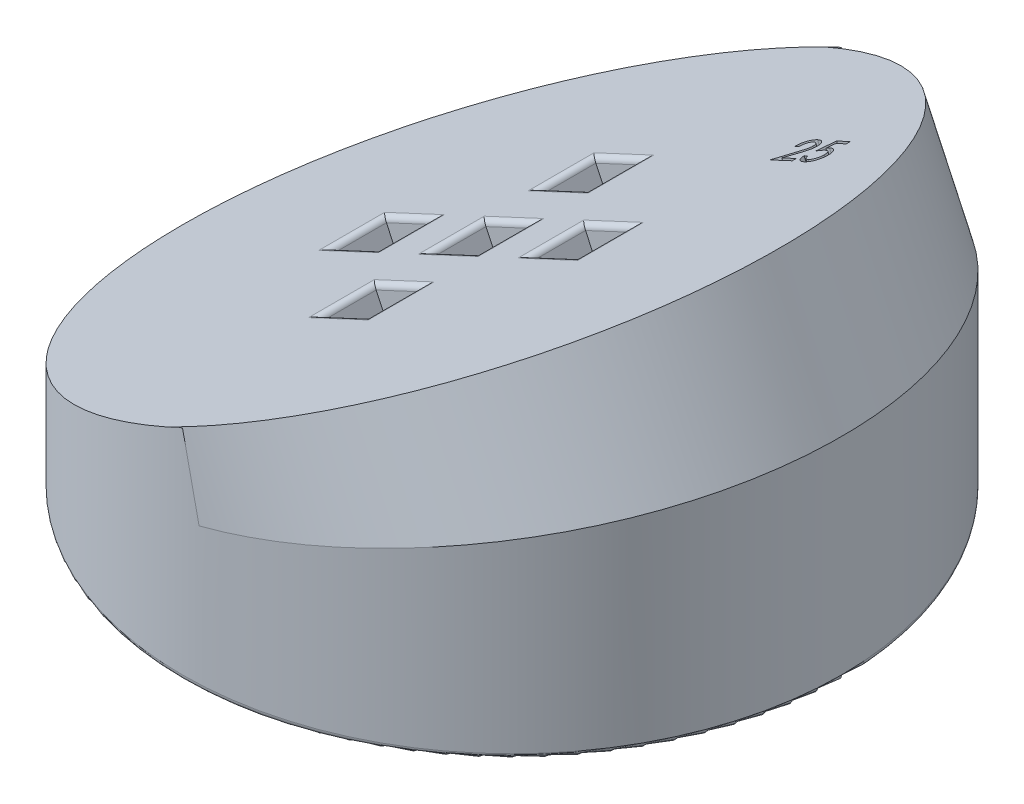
from build123d import *

# Parameters (mm, degrees)
SKETCH1_R           = 30
BOSS_EXTRUDE1_DEPTH = 50
SKETCH4_W           = 5
SKETCH4_H           = 5
CUT_EXTRUDE2_DEPTH  = 3
FILLET2_R           = 0.5
CUT_EXTRUDE10_DEPTH = 45
SKETCH15_W          = 5
SKETCH15_H          = 5
CUT_EXTRUDE11_DEPTH = 3
CUT_EXTRUDE13_DEPTH = 100
FILLET8_R           = 0.5
FILLET9_R           = 0.5
FILLET10_R          = 0.5
FILLET11_R          = 0.5
FILLET12_R          = 0.5
CUT_EXTRUDE14_DEPTH = 4


with BuildPart() as part:
    # Sketch1 → Boss-Extrude1 (new body)
    with BuildSketch(Plane(origin=(0, 0, 0), x_dir=(1, 0, 0), z_dir=(0, 1, 0))):
        with Locations(Location((0, 0, 0), (0, 0, 270))):
            Circle(SKETCH1_R)
    extrude(amount=BOSS_EXTRUDE1_DEPTH)

    # Sketch4 → Cut-Extrude2 (cut)
    with BuildSketch(Plane(origin=(0, 0, 0), x_dir=(-1, 0, 0), z_dir=(0, -1, 0))):
        Rectangle(SKETCH4_W, SKETCH4_H)
        with Locations((0, -10)):
            Rectangle(SKETCH4_W, SKETCH4_H)
        with Locations((10, 0)):
            Rectangle(SKETCH4_W, SKETCH4_H)
        with Locations((-10, 0)):
            Rectangle(SKETCH4_W, SKETCH4_H)
        with Locations((0, 10)):
            Rectangle(SKETCH4_W, SKETCH4_H)
    extrude(amount=-CUT_EXTRUDE2_DEPTH, mode=Mode.SUBTRACT)

    # Fillet2
    fillet2_edges = [part.edges().sort_by_distance(p)[0] for p in [
        (0, 0, -30),
        (-2.5, 0, 10),
        (0, 0, 7.5),
        (2.5, 0, 10),
        (0, 0, 12.5),
        (-12.5, 0, 0),
        (-10, 0, -2.5),
        (-7.5, 0, 0),
        (-10, 0, 2.5),
        (7.5, 0, 0),
        (10, 0, -2.5),
        (12.5, 0, 0),
        (10, 0, 2.5),
        (2.5, 0, -10),
        (0, 0, -7.5),
        (-2.5, 0, -10),
        (0, 0, -12.5),
        (-2.5, 0, 0),
        (0, 0, -2.5),
        (2.5, 0, 0),
        (0, 0, 2.5),
    ]]
    fillet(fillet2_edges, radius=FILLET2_R)

    # Sketch13 → Cut-Extrude10 (cut, symmetric)
    with BuildSketch(Plane.XY.offset(3.5)):
        Polygon((-30, 6), (30, 33.978459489), (30, 50), (-30, 50), align=None)
    extrude(amount=CUT_EXTRUDE10_DEPTH, both=True, mode=Mode.SUBTRACT)

    # Sketch15 → Cut-Extrude11 (cut)
    with BuildSketch(Plane(origin=(-7.656319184, 16.419029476, 0), x_dir=(0.9063077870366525, 0.4226182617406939, 0), z_dir=(-0.4226182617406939, 0.9063077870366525, 0))):
        with Locations((-4.653524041, 0)):
            Rectangle(SKETCH15_W, SKETCH15_H)
        with Locations((5.346475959, 0)):
            Rectangle(SKETCH15_W, SKETCH15_H)
        with Locations((15.346475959, 0)):
            Rectangle(SKETCH15_W, SKETCH15_H)
        with Locations((5.346475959, -10)):
            Rectangle(SKETCH15_W, SKETCH15_H)
        with Locations((5.346475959, 10)):
            Rectangle(SKETCH15_W, SKETCH15_H)
    extrude(amount=-CUT_EXTRUDE11_DEPTH, mode=Mode.SUBTRACT)

    # Sketch24 → Cut-Extrude13 (cut)
    with BuildSketch(Plane(origin=(-7.656319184, 16.419029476, 0), x_dir=(0.9063077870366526, 0.42261826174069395, 0), z_dir=(-0.42261826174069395, 0.9063077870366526, 0))):
        with BuildLine():
            ThreePointArc((6.820931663, 29.963744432), (35.346475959, 0), (6.820931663, -29.963744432))
            add(Edge.make_bspline(
                [(8.447813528, -30), (7.633880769, -30), (6.820931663, -29.963744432)],
                knots=[4.71238898, 4.71238898, 4.71238898, 4.766461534, 4.766461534, 4.766461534], degree=2, weights=[1, 0.989917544, 0.980529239]))
            add(Edge.make_bspline(
                [(41.549151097, 0), (41.549151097, -30), (8.447813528, -30)],
                knots=[3.141592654, 3.141592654, 3.141592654, 4.71238898, 4.71238898, 4.71238898], degree=2, weights=[1, 0.707106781, 1]))
            add(Edge.make_bspline(
                [(6.820931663, 29.963744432), (7.633880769, 30), (8.447813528, 30), (41.549151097, 30), (41.549151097, 0)],
                knots=[1.516723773, 1.516723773, 1.516723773, 1.570796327, 1.570796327, 3.141592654, 3.141592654, 3.141592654], degree=2, weights=[0.980529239, 0.989917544, 1, 0.707106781, 1]))
        make_face()
    extrude(amount=-CUT_EXTRUDE13_DEPTH, mode=Mode.SUBTRACT)

    # Fillet8
    fillet8_edges = [part.edges().sort_by_distance(p)[0] for p in [
        (-5.076535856, 17.622002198, -10),
        (-2.810766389, 18.678547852, -7.5),
        (-0.544996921, 19.735093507, -10),
        (-2.810766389, 18.678547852, -12.5),
    ]]
    fillet(fillet8_edges, radius=FILLET8_R)

    # Fillet9
    fillet9_edges = [part.edges().sort_by_distance(p)[0] for p in [
        (3.986542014, 21.848184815, 0),
        (6.252311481, 22.90473047, 2.5),
        (8.518080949, 23.961276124, 0),
        (6.252311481, 22.90473047, -2.5),
    ]]
    fillet(fillet9_edges, radius=FILLET9_R)

    # Fillet10
    fillet10_edges = [part.edges().sort_by_distance(p)[0] for p in [
        (-14.139613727, 13.39581958, 0),
        (-11.873844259, 14.452365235, 2.5),
        (-9.608074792, 15.508910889, 0),
        (-11.873844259, 14.452365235, -2.5),
    ]]
    fillet(fillet10_edges, radius=FILLET10_R)

    # Fillet11
    fillet11_edges = [part.edges().sort_by_distance(p)[0] for p in [
        (-5.076535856, 17.622002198, 10),
        (-2.810766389, 18.678547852, 12.5),
        (-0.544996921, 19.735093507, 10),
        (-2.810766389, 18.678547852, 7.5),
    ]]
    fillet(fillet11_edges, radius=FILLET11_R)

    # Fillet12
    fillet12_edges = [part.edges().sort_by_distance(p)[0] for p in [
        (-5.076535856, 17.622002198, 0),
        (-2.810766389, 18.678547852, 2.5),
        (-0.544996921, 19.735093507, 0),
        (-2.810766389, 18.678547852, -2.5),
    ]]
    fillet(fillet12_edges, radius=FILLET12_R)

    # Sketch25 → Cut-Extrude14 (cut)
    with BuildSketch(Plane(origin=(-7.656319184, 16.419029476, 0), x_dir=(0.9063077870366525, 0.4226182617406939, 0), z_dir=(-0.4226182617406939, 0.9063077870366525, 0))):
        with BuildLine():
            Line((20.596750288, 15.111406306), (20.19415113, 15.111406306))
            add(Edge.make_bspline(
                [(20.19415113, 15.111406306), (20.196042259, 15.152372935), (20.199741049, 15.232498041), (20.216165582, 15.349249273), (20.242772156, 15.459258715), (20.276355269, 15.563458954), (20.321154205, 15.660547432), (20.372843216, 15.75221665), (20.435243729, 15.8365454), (20.505759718, 15.913667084), (20.582307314, 15.983735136), (20.664596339, 16.044153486), (20.751235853, 16.095638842), (20.842242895, 16.137651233), (20.937795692, 16.170180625), (21.037621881, 16.193851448), (21.142039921, 16.208088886), (21.213219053, 16.209652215), (21.249304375, 16.210444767)],
                knots=[0, 0, 0, 0, 1.154964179, 2.258951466, 3.315045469, 4.34063582, 5.337653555, 6.322213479, 7.300594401, 8.285733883, 9.262436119, 10.219305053, 11.156568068, 12.097250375, 13.037875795, 13.995471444, 14.983774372, 16, 16, 16, 16], degree=3))
            add(Edge.make_bspline(
                [(21.249304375, 16.210444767), (21.287085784, 16.209671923), (21.361223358, 16.208155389), (21.46918552, 16.193884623), (21.571361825, 16.170873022), (21.667782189, 16.139447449), (21.758270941, 16.097486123), (21.843006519, 16.046885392), (21.921174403, 15.986065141), (21.993341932, 15.918011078), (22.057084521, 15.843151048), (22.11465717, 15.766186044), (22.162246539, 15.685555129), (22.202114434, 15.602730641), (22.232793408, 15.517032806), (22.254458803, 15.428810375), (22.267445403, 15.338003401), (22.269217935, 15.276600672), (22.270112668, 15.245606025)],
                knots=[0, 0, 0, 0, 1.156722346, 2.269809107, 3.328396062, 4.361258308, 5.3694338, 6.377253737, 7.377324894, 8.397019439, 9.4098266, 10.385180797, 11.337325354, 12.27255833, 13.196816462, 14.119704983, 15.050871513, 16, 16, 16, 16], degree=3))
            add(Edge.make_bspline(
                [(22.270112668, 15.245606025), (22.268484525, 15.202249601), (22.265250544, 15.1161307), (22.240347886, 14.98872273), (22.198483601, 14.865418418), (22.150126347, 14.765016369), (22.101218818, 14.683859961), (22.056336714, 14.616872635), (22.003611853, 14.544439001), (21.941913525, 14.467043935), (21.873695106, 14.382916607), (21.796246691, 14.294227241), (21.711965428, 14.19918026), (21.651857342, 14.135180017), (21.62073867, 14.10204633)],
                knots=[0, 0, 0, 0, 1.155755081, 2.295677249, 3.447123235, 4.6205014, 5.259503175, 5.973005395, 6.77029923, 7.648035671, 8.612336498, 9.658570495, 10.787814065, 12, 12, 12, 12], degree=3))
            Line((21.62073867, 14.10204633), (20.839709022, 13.320380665))
            Line((20.839709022, 13.320380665), (22.310817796, 13.320380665))
            Line((22.310817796, 13.320380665), (22.310817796, 12.954034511))
            Line((22.310817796, 12.954034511), (20.072035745, 12.954034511))
            Line((20.072035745, 12.954034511), (21.286829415, 14.295395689))
            add(Edge.make_bspline(
                [(21.286829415, 14.295395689), (21.31576419, 14.326254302), (21.371290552, 14.385472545), (21.449547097, 14.472158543), (21.520152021, 14.552298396), (21.583481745, 14.625834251), (21.637877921, 14.693754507), (21.684803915, 14.755059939), (21.723728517, 14.810040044), (21.764151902, 14.874756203), (21.804207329, 14.95233328), (21.838281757, 15.046966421), (21.858728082, 15.143607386), (21.861616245, 15.208622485), (21.863061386, 15.241153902)],
                knots=[0, 0, 0, 0, 1.341560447, 2.574479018, 3.703506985, 4.728875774, 5.651874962, 6.462761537, 7.177175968, 7.787249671, 8.88179658, 9.938774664, 10.968630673, 12, 12, 12, 12], degree=3))
            add(Edge.make_bspline(
                [(21.863061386, 15.241153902), (21.862705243, 15.261335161), (21.86200054, 15.301267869), (21.852393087, 15.359744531), (21.838859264, 15.41646364), (21.817927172, 15.470513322), (21.792707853, 15.522956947), (21.761162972, 15.573116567), (21.723283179, 15.620526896), (21.681145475, 15.666254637), (21.634540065, 15.707541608), (21.585313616, 15.744569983), (21.532860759, 15.774641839), (21.478615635, 15.800940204), (21.420892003, 15.819584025), (21.361108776, 15.833465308), (21.298796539, 15.843081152), (21.256337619, 15.843754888), (21.234675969, 15.844098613)],
                knots=[0, 0, 0, 0, 0.999432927, 1.977580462, 2.931018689, 3.885672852, 4.844657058, 5.812871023, 6.815890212, 7.849665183, 8.891901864, 9.898878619, 10.897592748, 11.885014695, 12.882178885, 13.896915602, 14.927050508, 16, 16, 16, 16], degree=3))
            add(Edge.make_bspline(
                [(21.234675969, 15.844098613), (21.214082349, 15.843676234), (21.17356929, 15.842845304), (21.113903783, 15.834272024), (21.056632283, 15.820313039), (21.001561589, 15.800950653), (20.948292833, 15.777063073), (20.898128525, 15.74611676), (20.850248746, 15.710116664), (20.804020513, 15.669711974), (20.761947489, 15.622309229), (20.724316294, 15.568470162), (20.691086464, 15.508136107), (20.662683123, 15.441412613), (20.639143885, 15.36812463), (20.620260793, 15.288361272), (20.605662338, 15.202087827), (20.599775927, 15.142192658), (20.596750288, 15.111406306)],
                knots=[0, 0, 0, 0, 0.911540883, 1.79324023, 2.663162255, 3.518366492, 4.375475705, 5.243419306, 6.122264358, 7.02676621, 7.957780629, 8.921596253, 9.930241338, 11.002848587, 12.128200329, 13.335197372, 14.630280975, 16, 16, 16, 16], degree=3))
        make_face()
        with BuildLine():
            Line((24.631010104, 16.129034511), (24.631010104, 15.762688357))
            Line((24.631010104, 15.762688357), (23.587941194, 15.762688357))
            Line((23.587941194, 15.762688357), (23.417488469, 15.010279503))
            add(Edge.make_bspline(
                [(23.417488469, 15.010279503), (23.437373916, 15.019862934), (23.478298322, 15.039585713), (23.546717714, 15.056770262), (23.621001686, 15.068861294), (23.672897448, 15.070071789), (23.699880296, 15.070701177)],
                knots=[0, 0, 0, 0, 0.906577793, 1.865744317, 2.890308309, 4, 4, 4, 4], degree=3))
            add(Edge.make_bspline(
                [(23.699880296, 15.070701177), (23.738096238, 15.07000148), (23.81312685, 15.068627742), (23.922477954, 15.053276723), (24.026679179, 15.03027884), (24.124873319, 14.995970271), (24.218181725, 14.953734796), (24.305592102, 14.900883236), (24.387013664, 14.838312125), (24.462337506, 14.767086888), (24.5309886, 14.689505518), (24.589950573, 14.605725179), (24.641060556, 14.518193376), (24.681573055, 14.425397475), (24.713582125, 14.328297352), (24.736346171, 14.226487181), (24.750817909, 14.120272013), (24.752349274, 14.047820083), (24.753125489, 14.011095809)],
                knots=[0, 0, 0, 0, 1.094894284, 2.149641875, 3.159658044, 4.149576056, 5.125966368, 6.091225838, 7.071072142, 8.064343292, 9.05924964, 10.03573454, 10.996966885, 11.96032995, 12.932910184, 13.923798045, 14.947619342, 16, 16, 16, 16], degree=3))
            add(Edge.make_bspline(
                [(24.753125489, 14.011095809), (24.752528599, 13.985433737), (24.751347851, 13.934669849), (24.745195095, 13.859187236), (24.733450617, 13.785332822), (24.717857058, 13.712536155), (24.696370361, 13.641421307), (24.671910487, 13.571042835), (24.64185958, 13.502522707), (24.607551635, 13.435889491), (24.569487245, 13.37163083), (24.527576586, 13.310526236), (24.481723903, 13.253064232), (24.431766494, 13.199725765), (24.379069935, 13.149139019), (24.322259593, 13.102624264), (24.261496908, 13.059986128), (24.197648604, 13.020758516), (24.130745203, 12.985319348), (24.060393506, 12.955976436), (23.988340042, 12.929315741), (23.912802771, 12.909353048), (23.835205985, 12.89255524), (23.754618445, 12.881407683), (23.671605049, 12.874139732), (23.615305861, 12.873135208), (23.586669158, 12.872624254)],
                knots=[0, 0, 0, 0, 1.012275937, 2.002451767, 2.98397589, 3.959820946, 4.936095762, 5.911940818, 6.896771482, 7.884012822, 8.866284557, 9.840372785, 10.804070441, 11.762530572, 12.720625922, 13.68308951, 14.655094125, 15.646011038, 16.637104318, 17.63729087, 18.650257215, 19.66446511, 20.715636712, 21.77986274, 22.870722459, 24, 24, 24, 24], degree=3))
            add(Edge.make_bspline(
                [(23.586669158, 12.872624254), (23.554415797, 12.873398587), (23.490786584, 12.874926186), (23.397334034, 12.885761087), (23.307681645, 12.90414471), (23.222209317, 12.930460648), (23.140281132, 12.963468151), (23.062595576, 13.004300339), (22.988850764, 13.052590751), (22.918951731, 13.107418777), (22.855201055, 13.169962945), (22.796436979, 13.237293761), (22.746369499, 13.311890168), (22.702325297, 13.39169358), (22.664481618, 13.477353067), (22.634375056, 13.569031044), (22.610301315, 13.66638032), (22.6006793, 13.733683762), (22.595753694, 13.768137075)],
                knots=[0, 0, 0, 0, 1.049569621, 2.070583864, 3.057046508, 4.023914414, 4.977170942, 5.927726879, 6.875021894, 7.842677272, 8.813672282, 9.777581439, 10.74592533, 11.731059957, 12.74126976, 13.788569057, 14.867946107, 16, 16, 16, 16], degree=3))
            Line((22.595753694, 13.768137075), (22.993264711, 13.768137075))
            add(Edge.make_bspline(
                [(22.993264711, 13.768137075), (23.000830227, 13.734863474), (23.015032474, 13.672401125), (23.045543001, 13.587291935), (23.078243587, 13.514905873), (23.118239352, 13.455706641), (23.164144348, 13.407113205), (23.215095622, 13.364932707), (23.271071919, 13.327095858), (23.332696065, 13.295688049), (23.397623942, 13.270242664), (23.4650862, 13.252483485), (23.533720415, 13.241316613), (23.58005553, 13.239752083), (23.603205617, 13.238970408)],
                knots=[0, 0, 0, 0, 1.385459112, 2.600831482, 3.66841355, 4.605180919, 5.48910649, 6.376050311, 7.288896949, 8.229144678, 9.181161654, 10.117453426, 11.059436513, 12, 12, 12, 12], degree=3))
            add(Edge.make_bspline(
                [(23.603205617, 13.238970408), (23.628248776, 13.239811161), (23.677691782, 13.24147107), (23.750529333, 13.251408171), (23.820189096, 13.269789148), (23.887676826, 13.293614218), (23.951813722, 13.326064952), (24.014174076, 13.363955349), (24.072483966, 13.410483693), (24.128373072, 13.462217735), (24.179561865, 13.519521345), (24.224134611, 13.581435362), (24.262157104, 13.646716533), (24.292457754, 13.71579906), (24.317049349, 13.788049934), (24.33395261, 13.863962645), (24.344498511, 13.943378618), (24.345542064, 13.997493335), (24.346074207, 14.025088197)],
                knots=[0, 0, 0, 0, 0.99750234, 1.969380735, 2.919490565, 3.862219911, 4.813679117, 5.776605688, 6.762898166, 7.778387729, 8.806918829, 9.816812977, 10.811632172, 11.809420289, 12.815921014, 13.846113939, 14.901663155, 16, 16, 16, 16], degree=3))
            add(Edge.make_bspline(
                [(24.346074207, 14.025088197), (24.345441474, 14.049709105), (24.344199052, 14.098054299), (24.335098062, 14.168712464), (24.320662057, 14.236111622), (24.299685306, 14.299618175), (24.272720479, 14.359583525), (24.23956209, 14.415624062), (24.200311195, 14.468051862), (24.156169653, 14.51703683), (24.106200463, 14.560805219), (24.052548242, 14.599977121), (23.993583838, 14.631658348), (23.931433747, 14.65876928), (23.86466037, 14.678582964), (23.794459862, 14.694548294), (23.719553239, 14.702218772), (23.668303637, 14.703630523), (23.642002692, 14.704355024)],
                knots=[0, 0, 0, 0, 1.071512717, 2.104004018, 3.095982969, 4.067795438, 5.009520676, 5.952827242, 6.895998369, 7.856350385, 8.817411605, 9.782937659, 10.74115891, 11.725120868, 12.729302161, 13.768330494, 14.854722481, 16, 16, 16, 16], degree=3))
            add(Edge.make_bspline(
                [(23.642002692, 14.704355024), (23.619511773, 14.703815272), (23.572294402, 14.702682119), (23.498407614, 14.694488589), (23.418004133, 14.681601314), (23.3312111, 14.663777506), (23.237945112, 14.640556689), (23.138092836, 14.612418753), (23.031543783, 14.579585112), (22.958847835, 14.554472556), (22.921394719, 14.541534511)],
                knots=[0, 0, 0, 0, 0.727614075, 1.527550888, 2.402655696, 3.361819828, 4.39328773, 5.511706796, 6.718025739, 8, 8, 8, 8], degree=3))
            Line((22.921394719, 14.541534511), (23.254667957, 16.129034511))
            Line((23.254667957, 16.129034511), (24.631010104, 16.129034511))
        make_face()
    extrude(amount=-CUT_EXTRUDE14_DEPTH, mode=Mode.SUBTRACT)


solid = part.part
